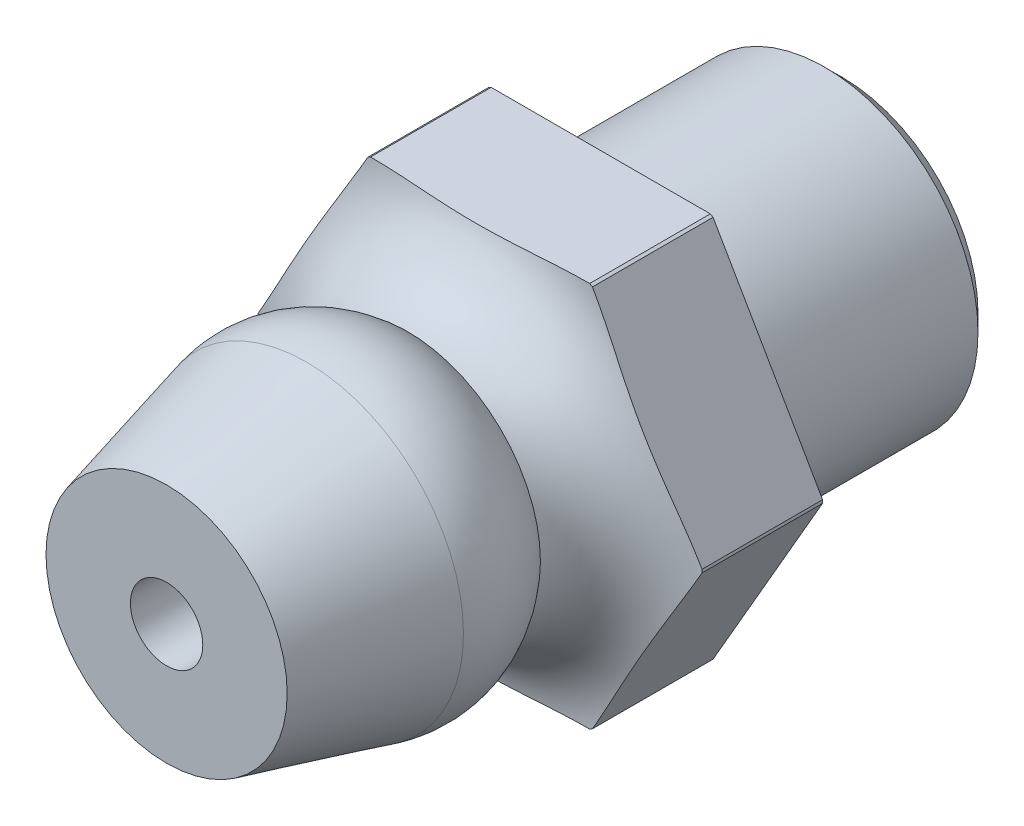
ISO-10303-21;
HEADER;
FILE_DESCRIPTION(('STEP AP214'),'2;1');
FILE_NAME('part.step','',(''),(''),'','','');
FILE_SCHEMA(('AUTOMOTIVE_DESIGN { 1 0 10303 214 1 1 1 1 }'));
ENDSEC;
DATA;
#1=APPLICATION_CONTEXT('core data for automotive mechanical design processes');
#2=APPLICATION_PROTOCOL_DEFINITION('international standard','automotive_design',2000,#1);
#3=PRODUCT_CONTEXT('',#1,'mechanical');
#4=PRODUCT('Part','Part','',(#3));
#5=PRODUCT_RELATED_PRODUCT_CATEGORY('part','',(#4));
#6=PRODUCT_DEFINITION_FORMATION('','',#4);
#7=PRODUCT_DEFINITION_CONTEXT('part definition',#1,'design');
#8=PRODUCT_DEFINITION('design','',#6,#7);
#9=PRODUCT_DEFINITION_SHAPE('','',#8);
#10=(LENGTH_UNIT() NAMED_UNIT(*) SI_UNIT(.MILLI.,.METRE.));
#11=(NAMED_UNIT(*) PLANE_ANGLE_UNIT() SI_UNIT($,.RADIAN.));
#12=(NAMED_UNIT(*) SI_UNIT($,.STERADIAN.) SOLID_ANGLE_UNIT());
#13=UNCERTAINTY_MEASURE_WITH_UNIT(LENGTH_MEASURE(1.E-05),#10,'distance_accuracy_value','');
#14=(GEOMETRIC_REPRESENTATION_CONTEXT(3) GLOBAL_UNCERTAINTY_ASSIGNED_CONTEXT((#13)) GLOBAL_UNIT_ASSIGNED_CONTEXT((#10,
#11,#12)) REPRESENTATION_CONTEXT('',''));
#15=CARTESIAN_POINT('',(0.,0.,0.));
#16=DIRECTION('',(0.,0.,1.));
#17=DIRECTION('',(1.,0.,0.));
#18=AXIS2_PLACEMENT_3D('',#15,#16,#17);
#19=CARTESIAN_POINT('',(0.,0.,4.39083333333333));
#20=DIRECTION('',(0.,0.,1.));
#21=DIRECTION('',(1.,0.,0.));
#22=AXIS2_PLACEMENT_3D('',#19,#20,#21);
#23=TOROIDAL_SURFACE('',#22,4.6,1.89083333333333);
#24=CARTESIAN_POINT('',(0.,0.,4.));
#25=DIRECTION('',(0.,0.,1.));
#26=DIRECTION('',(1.,0.,0.));
#27=AXIS2_PLACEMENT_3D('',#24,#25,#26);
#28=CIRCLE('',#27,2.75);
#29=CARTESIAN_POINT('',(2.75,0.,4.));
#30=VERTEX_POINT('',#29);
#31=EDGE_CURVE('E143',#30,#30,#28,.T.);
#32=ORIENTED_EDGE('',*,*,#31,.F.);
#33=EDGE_LOOP('',(#32));
#34=FACE_BOUND('',#33,.T.);
#35=CARTESIAN_POINT('',(0.,0.,2.5));
#36=DIRECTION('',(0.,0.,1.));
#37=DIRECTION('',(1.,0.,0.));
#38=AXIS2_PLACEMENT_3D('',#35,#36,#37);
#39=CIRCLE('',#38,4.6);
#40=CARTESIAN_POINT('',(-4.59988328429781,0.0327684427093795,2.5));
#41=VERTEX_POINT('',#40);
#42=CARTESIAN_POINT('',(-4.59988328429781,-0.0327684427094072,2.5));
#43=VERTEX_POINT('',#42);
#44=EDGE_CURVE('E184',#41,#43,#39,.T.);
#45=ORIENTED_EDGE('',*,*,#44,.T.);
#46=CARTESIAN_POINT('',(-4.6002,-0.0322198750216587,2.50000002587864));
#47=CARTESIAN_POINT('',(-4.52118096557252,-0.169084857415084,2.50001952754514));
#48=CARTESIAN_POINT('',(-4.44225115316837,-0.305795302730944,2.50480865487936));
#49=CARTESIAN_POINT('',(-4.28450655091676,-0.579016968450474,2.51954652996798));
#50=CARTESIAN_POINT('',(-4.20569175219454,-0.715528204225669,2.52949485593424));
#51=CARTESIAN_POINT('',(-4.04831823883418,-0.988107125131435,2.5501444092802));
#52=CARTESIAN_POINT('',(-3.96975941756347,-1.12417499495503,2.56084348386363));
#53=CARTESIAN_POINT('',(-3.81255747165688,-1.39645675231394,2.57921557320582));
#54=CARTESIAN_POINT('',(-3.73391437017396,-1.53267059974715,2.58688927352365));
#55=CARTESIAN_POINT('',(-3.57635851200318,-1.80556535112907,2.5965744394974));
#56=CARTESIAN_POINT('',(-3.49744554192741,-1.94224662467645,2.59857346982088));
#57=CARTESIAN_POINT('',(-3.33963748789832,-2.21557819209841,2.59617536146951));
#58=CARTESIAN_POINT('',(-3.26074240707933,-2.35222848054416,2.59177748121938));
#59=CARTESIAN_POINT('',(-3.10307853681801,-2.6253103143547,2.57811697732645));
#60=CARTESIAN_POINT('',(-3.02430973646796,-2.76174187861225,2.56885479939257));
#61=CARTESIAN_POINT('',(-2.8668290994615,-3.03450634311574,2.54868193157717));
#62=CARTESIAN_POINT('',(-2.78811726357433,-3.17083924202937,2.53777121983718));
#63=CARTESIAN_POINT('',(-2.67606454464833,-3.36492024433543,2.52398401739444));
#64=CARTESIAN_POINT('',(-2.64275643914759,-3.42261157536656,2.52010491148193));
#65=CARTESIAN_POINT('',(-2.5761265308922,-3.53801796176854,2.5131172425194));
#66=CARTESIAN_POINT('',(-2.54280473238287,-3.59573300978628,2.51000852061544));
#67=CARTESIAN_POINT('',(-2.47613243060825,-3.7112128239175,2.5048940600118));
#68=CARTESIAN_POINT('',(-2.44278192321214,-3.76897759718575,2.50288852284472));
#69=CARTESIAN_POINT('',(-2.37605013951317,-3.88456043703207,2.50032169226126));
#70=CARTESIAN_POINT('',(-2.34266885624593,-3.94237851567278,2.49976115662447));
#71=CARTESIAN_POINT('',(-2.30928560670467,-4.0002,2.5000946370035));
#72=B_SPLINE_CURVE_WITH_KNOTS('',3,(#46,#47,#48,#49,#50,#51,#52,#53,#54,#55,#56,#57,#58,#59,#60,
#61,#62,#63,#64,#65,#66,#67,#68,#69,#70,#71),.UNSPECIFIED.,.F.,.F.,(4,2,2,2,2,2,2,2,2,2,2,2,4),
(0.,0.473805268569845,0.947571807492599,1.42003133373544,1.89238373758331,2.3657704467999,
2.83921203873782,3.312610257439,3.78601475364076,3.9861985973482,4.18634112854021,
4.38652021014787,4.58680424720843),.UNSPECIFIED.);
#73=CARTESIAN_POINT('',(-2.32831994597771,-3.9672315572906,2.5));
#74=VERTEX_POINT('',#73);
#75=EDGE_CURVE('E188',#43,#74,#72,.T.);
#76=ORIENTED_EDGE('',*,*,#75,.T.);
#77=CARTESIAN_POINT('',(-2.2715633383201,-4.,2.5));
#78=VERTEX_POINT('',#77);
#79=EDGE_CURVE('E270',#74,#78,#39,.T.);
#80=ORIENTED_EDGE('',*,*,#79,.T.);
#81=CARTESIAN_POINT('',(0.,-4.,2.59772131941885));
#82=CARTESIAN_POINT('',(0.080272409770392,-4.,2.59772363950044));
#83=CARTESIAN_POINT('',(0.160543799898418,-4.,2.59690584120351));
#84=CARTESIAN_POINT('',(0.32105656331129,-4.,2.59372303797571));
#85=CARTESIAN_POINT('',(0.401297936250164,-4.,2.59135801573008));
#86=CARTESIAN_POINT('',(0.641978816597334,-4.,2.58222964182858));
#87=CARTESIAN_POINT('',(0.802337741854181,-4.,2.57343313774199));
#88=CARTESIAN_POINT('',(1.12420710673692,-4.,2.55343026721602));
#89=CARTESIAN_POINT('',(1.28571615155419,-4.,2.54220464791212));
#90=CARTESIAN_POINT('',(1.60885475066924,-4.,2.52173063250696));
#91=CARTESIAN_POINT('',(1.77048428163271,-4.,2.51248192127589));
#92=CARTESIAN_POINT('',(2.08932881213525,-4.,2.5008725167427));
#93=CARTESIAN_POINT('',(2.24653504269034,-4.,2.49831875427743));
#94=CARTESIAN_POINT('',(2.56097782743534,-4.,2.50403451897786));
#95=CARTESIAN_POINT('',(2.718214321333,-4.,2.51231187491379));
#96=CARTESIAN_POINT('',(3.02937330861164,-4.,2.54407704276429));
#97=CARTESIAN_POINT('',(3.18331297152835,-4.,2.56738264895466));
#98=CARTESIAN_POINT('',(3.48686461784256,-4.,2.63342439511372));
#99=CARTESIAN_POINT('',(3.63648729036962,-4.,2.67610719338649));
#100=CARTESIAN_POINT('',(3.83195287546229,-4.,2.74926719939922));
#101=CARTESIAN_POINT('',(3.8817060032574,-4.,2.76948701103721));
#102=CARTESIAN_POINT('',(3.97996364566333,-4.,2.81289009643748));
#103=CARTESIAN_POINT('',(4.02846681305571,-4.,2.83607641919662));
#104=CARTESIAN_POINT('',(4.17200571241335,-4.,2.91047207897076));
#105=CARTESIAN_POINT('',(4.2646883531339,-4.,2.9663787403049));
#106=CARTESIAN_POINT('',(4.44133965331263,-4.,3.09163201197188));
#107=CARTESIAN_POINT('',(4.52525744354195,-4.,3.16105103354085));
#108=CARTESIAN_POINT('',(4.68023083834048,-4.,3.3129477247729));
#109=CARTESIAN_POINT('',(4.75130973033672,-4.,3.39540123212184));
#110=CARTESIAN_POINT('',(4.86645546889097,-4.,3.5573731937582));
#111=CARTESIAN_POINT('',(4.91304964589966,-4.,3.63509239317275));
#112=CARTESIAN_POINT('',(4.99265010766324,-4.,3.79724483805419));
#113=CARTESIAN_POINT('',(5.0256604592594,-4.,3.8816760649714));
#114=CARTESIAN_POINT('',(5.076451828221,-4.,4.05538704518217));
#115=CARTESIAN_POINT('',(5.094174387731,-4.,4.14468403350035));
#116=CARTESIAN_POINT('',(5.11313553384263,-4.,4.32501625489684));
#117=CARTESIAN_POINT('',(5.11437742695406,-4.,4.41605113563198));
#118=CARTESIAN_POINT('',(5.10080162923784,-4.,4.59062820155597));
#119=CARTESIAN_POINT('',(5.08707400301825,-4.,4.67425778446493));
#120=CARTESIAN_POINT('',(5.04597431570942,-4.,4.83806997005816));
#121=CARTESIAN_POINT('',(5.01860254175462,-4.,4.91825264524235));
#122=CARTESIAN_POINT('',(4.95097042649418,-4.,5.0744781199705));
#123=CARTESIAN_POINT('',(4.91051023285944,-4.,5.15043379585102));
#124=CARTESIAN_POINT('',(4.81859470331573,-4.,5.29532218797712));
#125=CARTESIAN_POINT('',(4.76713751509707,-4.,5.36425371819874));
#126=CARTESIAN_POINT('',(4.64910091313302,-4.,5.50117514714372));
#127=CARTESIAN_POINT('',(4.5814923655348,-4.,5.56827437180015));
#128=CARTESIAN_POINT('',(4.43754892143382,-4.,5.69234803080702));
#129=CARTESIAN_POINT('',(4.36120534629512,-4.,5.74931224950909));
#130=CARTESIAN_POINT('',(4.15873784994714,-4.,5.88139954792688));
#131=CARTESIAN_POINT('',(4.0280835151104,-4.,5.94959959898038));
#132=CARTESIAN_POINT('',(3.75777457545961,-4.,6.06415614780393));
#133=CARTESIAN_POINT('',(3.61811227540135,-4.,6.11049368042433));
#134=CARTESIAN_POINT('',(3.24178442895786,-4.,6.20875627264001));
#135=CARTESIAN_POINT('',(3.00105571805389,-4.,6.24474749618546));
#136=CARTESIAN_POINT('',(2.51666239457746,-4.,6.28290060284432));
#137=CARTESIAN_POINT('',(2.27298889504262,-4.,6.28487258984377));
#138=CARTESIAN_POINT('',(1.78205834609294,-4.,6.27140096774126));
#139=CARTESIAN_POINT('',(1.53481551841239,-4.,6.25564399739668));
#140=CARTESIAN_POINT('',(1.16405679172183,-4.,6.23118207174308));
#141=CARTESIAN_POINT('',(1.04048341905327,-4.,6.22289001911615));
#142=CARTESIAN_POINT('',(0.793238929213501,-4.,6.20787020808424));
#143=CARTESIAN_POINT('',(0.669567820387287,-4.,6.20114232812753));
#144=CARTESIAN_POINT('',(0.422177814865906,-4.,6.19071352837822));
#145=CARTESIAN_POINT('',(0.298459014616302,-4.,6.1870104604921));
#146=CARTESIAN_POINT('',(0.0509657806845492,-4.,6.18342347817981));
#147=CARTESIAN_POINT('',(-0.072808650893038,-4.,6.18353942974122));
#148=CARTESIAN_POINT('',(-0.320311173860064,-4.,6.18756690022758));
#149=CARTESIAN_POINT('',(-0.444039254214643,-4.,6.19147904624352));
#150=CARTESIAN_POINT('',(-0.691368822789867,-4.,6.20224854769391));
#151=CARTESIAN_POINT('',(-0.814970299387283,-4.,6.20910615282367));
#152=CARTESIAN_POINT('',(-1.11812094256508,-4.,6.22774882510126));
#153=CARTESIAN_POINT('',(-1.29761391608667,-4.,6.24035795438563));
#154=CARTESIAN_POINT('',(-1.65690667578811,-4.,6.26281492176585));
#155=CARTESIAN_POINT('',(-1.83670657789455,-4.,6.27266119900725));
#156=CARTESIAN_POINT('',(-2.19569349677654,-4.,6.28297282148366));
#157=CARTESIAN_POINT('',(-2.37487848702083,-4.,6.28348918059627));
#158=CARTESIAN_POINT('',(-2.73252045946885,-4.,6.26860507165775));
#159=CARTESIAN_POINT('',(-2.91097816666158,-4.,6.25323241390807));
#160=CARTESIAN_POINT('',(-3.21831375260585,-4.,6.20687138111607));
#161=CARTESIAN_POINT('',(-3.3479380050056,-4.,6.18102605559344));
#162=CARTESIAN_POINT('',(-3.60370428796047,-4.,6.1142682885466));
#163=CARTESIAN_POINT('',(-3.72983757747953,-4.,6.07332116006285));
#164=CARTESIAN_POINT('',(-3.9762918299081,-4.,5.97347875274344));
#165=CARTESIAN_POINT('',(-4.09654964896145,-4.,5.91442394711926));
#166=CARTESIAN_POINT('',(-4.32522585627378,-4.,5.77671326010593));
#167=CARTESIAN_POINT('',(-4.43367132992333,-4.,5.69810363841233));
#168=CARTESIAN_POINT('',(-4.60707988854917,-4.,5.5438683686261));
#169=CARTESIAN_POINT('',(-4.67603349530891,-4.,5.47273351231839));
#170=CARTESIAN_POINT('',(-4.80145678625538,-4.,5.32009845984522));
#171=CARTESIAN_POINT('',(-4.85792914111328,-4.,5.23860048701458));
#172=CARTESIAN_POINT('',(-4.95584392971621,-4.,5.06620814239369));
#173=CARTESIAN_POINT('',(-4.99718171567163,-4.,4.9752537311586));
#174=CARTESIAN_POINT('',(-5.0617162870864,-4.,4.78710679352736));
#175=CARTESIAN_POINT('',(-5.08492522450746,-4.,4.68991849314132));
#176=CARTESIAN_POINT('',(-5.11013289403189,-4.,4.50408480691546));
#177=CARTESIAN_POINT('',(-5.11423933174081,-4.,4.41572123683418));
#178=CARTESIAN_POINT('',(-5.10676487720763,-4.,4.23967677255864));
#179=CARTESIAN_POINT('',(-5.09518867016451,-4.,4.15199568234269));
#180=CARTESIAN_POINT('',(-5.05789508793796,-4.,3.98399693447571));
#181=CARTESIAN_POINT('',(-5.03285717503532,-4.,3.90352630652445));
#182=CARTESIAN_POINT('',(-4.97031813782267,-4.,3.74761656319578));
#183=CARTESIAN_POINT('',(-4.93281621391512,-4.,3.67217777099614));
#184=CARTESIAN_POINT('',(-4.84454915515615,-4.,3.52380400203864));
#185=CARTESIAN_POINT('',(-4.7931639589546,-4.,3.45123972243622));
#186=CARTESIAN_POINT('',(-4.6803493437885,-4.,3.31443086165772));
#187=CARTESIAN_POINT('',(-4.61891443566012,-4.,3.25019086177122));
#188=CARTESIAN_POINT('',(-4.4611556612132,-4.,3.10597724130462));
#189=CARTESIAN_POINT('',(-4.36085180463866,-4.,3.0303450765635));
#190=CARTESIAN_POINT('',(-4.14928685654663,-4.,2.89639773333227));
#191=CARTESIAN_POINT('',(-4.03800451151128,-4.,2.83811705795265));
#192=CARTESIAN_POINT('',(-3.75753632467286,-4.,2.71526557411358));
#193=CARTESIAN_POINT('',(-3.58457329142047,-4.,2.65938472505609));
#194=CARTESIAN_POINT('',(-3.23259009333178,-4.,2.57500055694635));
#195=CARTESIAN_POINT('',(-3.05356837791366,-4.,2.54650430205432));
#196=CARTESIAN_POINT('',(-2.6368623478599,-4.,2.50406341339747));
#197=CARTESIAN_POINT('',(-2.39850724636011,-4.,2.49755675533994));
#198=CARTESIAN_POINT('',(-1.92167011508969,-4.,2.50398650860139));
#199=CARTESIAN_POINT('',(-1.68319112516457,-4.,2.51699782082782));
#200=CARTESIAN_POINT('',(-1.32429429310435,-4.,2.53977206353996));
#201=CARTESIAN_POINT('',(-1.20375328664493,-4.,2.5479643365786));
#202=CARTESIAN_POINT('',(-0.962616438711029,-4.,2.5636202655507));
#203=CARTESIAN_POINT('',(-0.842020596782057,-4.,2.5710839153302));
#204=CARTESIAN_POINT('',(-0.601231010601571,-4.,2.58370127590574));
#205=CARTESIAN_POINT('',(-0.48103782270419,-4.,2.58886497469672));
#206=CARTESIAN_POINT('',(-0.240562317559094,-4.,2.59587303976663));
#207=CARTESIAN_POINT('',(-0.120280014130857,-4.,2.59771784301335));
#208=CARTESIAN_POINT('',(0.,-4.,2.59772131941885));
#209=B_SPLINE_CURVE_WITH_KNOTS('',3,(#81,#82,#83,#84,#85,#86,#87,#88,#89,#90,#91,#92,#93,#94,
#95,#96,#97,#98,#99,#100,#101,#102,#103,#104,#105,#106,#107,#108,#109,#110,#111,#112,#113,#114,
#115,#116,#117,#118,#119,#120,#121,#122,#123,#124,#125,#126,#127,#128,#129,#130,#131,#132,#133,
#134,#135,#136,#137,#138,#139,#140,#141,#142,#143,#144,#145,#146,#147,#148,#149,#150,#151,#152,
#153,#154,#155,#156,#157,#158,#159,#160,#161,#162,#163,#164,#165,#166,#167,#168,#169,#170,#171,
#172,#173,#174,#175,#176,#177,#178,#179,#180,#181,#182,#183,#184,#185,#186,#187,#188,#189,#190,
#191,#192,#193,#194,#195,#196,#197,#198,#199,#200,#201,#202,#203,#204,#205,#206,#207,#208),
.UNSPECIFIED.,.T.,.F.,(4,2,2,2,2,2,2,2,2,2,2,2,2,2,2,2,2,2,2,2,2,2,2,2,2,2,2,2,2,2,2,2,2,2,2,2,
2,2,2,2,2,2,2,2,2,2,2,2,2,2,2,2,2,2,2,2,2,2,2,2,2,2,2,4),(0.,0.24081176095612,0.48162621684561,
0.963367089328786,1.44907598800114,1.93470740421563,2.40617178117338,2.87797712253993,
3.3441670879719,3.80908143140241,3.97011518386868,4.13131579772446,4.45492982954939,
4.78032834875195,5.10513059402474,5.37582486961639,5.64643804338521,5.91808146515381,
6.18967038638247,6.44272707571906,6.6957784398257,6.95289216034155,7.21004922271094,
7.49473392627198,7.77970397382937,8.21933087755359,8.65933844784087,9.38525528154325,
10.1152228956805,10.8582982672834,11.2298643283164,11.6014015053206,11.9726746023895,
12.3439346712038,12.7152560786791,13.0866089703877,13.6264253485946,14.1665460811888,
14.7037126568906,15.2399406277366,15.635756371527,16.0324869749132,16.4328183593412,
16.8322115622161,17.1282632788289,17.4242515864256,17.7222494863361,18.0200474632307,
18.2840578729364,18.547989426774,18.7997025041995,19.0514317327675,19.3171172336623,
19.5829483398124,19.957723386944,20.3332387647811,20.8754297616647,21.4177605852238,
22.1313703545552,22.8477256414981,23.2101917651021,23.5726609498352,23.9335403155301,
24.2943721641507),.UNSPECIFIED.);
#210=CARTESIAN_POINT('',(2.2715633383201,-4.,2.5));
#211=VERTEX_POINT('',#210);
#212=EDGE_CURVE('E124',#78,#211,#209,.T.);
#213=ORIENTED_EDGE('',*,*,#212,.T.);
#214=CARTESIAN_POINT('',(2.32831994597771,-3.96723155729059,2.5));
#215=VERTEX_POINT('',#214);
#216=EDGE_CURVE('E122',#211,#215,#39,.T.);
#217=ORIENTED_EDGE('',*,*,#216,.T.);
#218=CARTESIAN_POINT('',(2.30928560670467,-4.0002,2.5000946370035));
#219=CARTESIAN_POINT('',(2.38830838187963,-3.86332853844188,2.49933452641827));
#220=CARTESIAN_POINT('',(2.46724836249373,-3.72660048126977,2.5035288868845));
#221=CARTESIAN_POINT('',(2.6250010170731,-3.45336486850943,2.51742683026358));
#222=CARTESIAN_POINT('',(2.70381371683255,-3.3168572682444,2.52712910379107));
#223=CARTESIAN_POINT('',(2.86120164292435,-3.0442533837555,2.54762275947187));
#224=CARTESIAN_POINT('',(2.93977699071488,-2.90815688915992,2.55841151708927));
#225=CARTESIAN_POINT('',(3.09700999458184,-2.63582133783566,2.57723184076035));
#226=CARTESIAN_POINT('',(3.17566763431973,-2.49958230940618,2.58526387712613));
#227=CARTESIAN_POINT('',(3.33323523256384,-2.22666722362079,2.59580826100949));
#228=CARTESIAN_POINT('',(3.41214538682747,-2.08999082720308,2.59831012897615));
#229=CARTESIAN_POINT('',(3.56995554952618,-1.8166556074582,2.5968895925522));
#230=CARTESIAN_POINT('',(3.64885555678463,-1.67999678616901,2.59296671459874));
#231=CARTESIAN_POINT('',(3.8065258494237,-1.4069038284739,2.58006459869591));
#232=CARTESIAN_POINT('',(3.88529615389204,-1.27046965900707,2.57108618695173));
#233=CARTESIAN_POINT('',(4.04277213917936,-0.997713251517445,2.55118641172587));
#234=CARTESIAN_POINT('',(4.12147781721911,-0.861391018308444,2.54026496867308));
#235=CARTESIAN_POINT('',(4.23351112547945,-0.667343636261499,2.52622181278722));
#236=CARTESIAN_POINT('',(4.26681008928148,-0.609668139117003,2.52223660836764));
#237=CARTESIAN_POINT('',(4.33342155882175,-0.494293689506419,2.51497459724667));
#238=CARTESIAN_POINT('',(4.36673406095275,-0.436594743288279,2.51169766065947));
#239=CARTESIAN_POINT('',(4.43338899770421,-0.321145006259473,2.50618328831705));
#240=CARTESIAN_POINT('',(4.46673143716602,-0.263394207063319,2.50394607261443));
#241=CARTESIAN_POINT('',(4.53344791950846,-0.147837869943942,2.500851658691));
#242=CARTESIAN_POINT('',(4.56682196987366,-0.0900323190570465,2.49999513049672));
#243=CARTESIAN_POINT('',(4.6002,-0.0322198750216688,2.50000002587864));
#244=B_SPLINE_CURVE_WITH_KNOTS('',3,(#218,#219,#220,#221,#222,#223,#224,#225,#226,#227,#228,
#229,#230,#231,#232,#233,#234,#235,#236,#237,#238,#239,#240,#241,#242,#243),.UNSPECIFIED.,.F.,
.F.,(4,2,2,2,2,2,2,2,2,2,2,2,4),(0.,0.473810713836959,0.947508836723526,1.42008894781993,
1.8925883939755,2.36598245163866,2.83941140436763,3.31276300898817,3.78613400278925,
3.98628249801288,4.18639425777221,4.38654835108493,4.58679954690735),.UNSPECIFIED.);
#245=CARTESIAN_POINT('',(4.59988328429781,-0.0327684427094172,2.5));
#246=VERTEX_POINT('',#245);
#247=EDGE_CURVE('E227',#215,#246,#244,.T.);
#248=ORIENTED_EDGE('',*,*,#247,.T.);
#249=CARTESIAN_POINT('',(4.59988328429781,0.0327684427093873,2.5));
#250=VERTEX_POINT('',#249);
#251=EDGE_CURVE('E139',#246,#250,#39,.T.);
#252=ORIENTED_EDGE('',*,*,#251,.T.);
#253=CARTESIAN_POINT('',(4.6002,0.0322198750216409,2.50000002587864));
#254=CARTESIAN_POINT('',(4.52118096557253,0.16908485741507,2.50001952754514));
#255=CARTESIAN_POINT('',(4.44225115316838,0.305795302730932,2.50480865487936));
#256=CARTESIAN_POINT('',(4.28450655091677,0.579016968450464,2.51954652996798));
#257=CARTESIAN_POINT('',(4.20569175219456,0.715528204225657,2.52949485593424));
#258=CARTESIAN_POINT('',(4.04831823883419,0.988107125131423,2.5501444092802));
#259=CARTESIAN_POINT('',(3.96975941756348,1.12417499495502,2.56084348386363));
#260=CARTESIAN_POINT('',(3.81255747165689,1.39645675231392,2.57921557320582));
#261=CARTESIAN_POINT('',(3.73391437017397,1.53267059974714,2.58688927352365));
#262=CARTESIAN_POINT('',(3.57635851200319,1.80556535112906,2.59657443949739));
#263=CARTESIAN_POINT('',(3.49744554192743,1.94224662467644,2.59857346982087));
#264=CARTESIAN_POINT('',(3.33963748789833,2.2155781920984,2.5961753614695));
#265=CARTESIAN_POINT('',(3.26074240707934,2.35222848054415,2.59177748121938));
#266=CARTESIAN_POINT('',(3.10307853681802,2.6253103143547,2.57811697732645));
#267=CARTESIAN_POINT('',(3.02430973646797,2.76174187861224,2.56885479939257));
#268=CARTESIAN_POINT('',(2.86682909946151,3.03450634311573,2.54868193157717));
#269=CARTESIAN_POINT('',(2.78811726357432,3.17083924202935,2.53777121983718));
#270=CARTESIAN_POINT('',(2.67606454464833,3.36492024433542,2.52398401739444));
#271=CARTESIAN_POINT('',(2.6427564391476,3.42261157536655,2.52010491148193));
#272=CARTESIAN_POINT('',(2.57612653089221,3.53801796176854,2.5131172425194));
#273=CARTESIAN_POINT('',(2.54280473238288,3.59573300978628,2.51000852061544));
#274=CARTESIAN_POINT('',(2.47613243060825,3.7112128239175,2.5048940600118));
#275=CARTESIAN_POINT('',(2.44278192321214,3.76897759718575,2.50288852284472));
#276=CARTESIAN_POINT('',(2.37605013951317,3.88456043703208,2.50032169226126));
#277=CARTESIAN_POINT('',(2.34266885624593,3.94237851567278,2.49976115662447));
#278=CARTESIAN_POINT('',(2.30928560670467,4.0002,2.5000946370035));
#279=B_SPLINE_CURVE_WITH_KNOTS('',3,(#253,#254,#255,#256,#257,#258,#259,#260,#261,#262,#263,
#264,#265,#266,#267,#268,#269,#270,#271,#272,#273,#274,#275,#276,#277,#278),.UNSPECIFIED.,.F.,
.F.,(4,2,2,2,2,2,2,2,2,2,2,2,4),(0.,0.473805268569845,0.947571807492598,1.42003133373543,
1.89238373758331,2.3657704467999,2.83921203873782,3.312610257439,3.78601475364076,
3.9861985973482,4.18634112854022,4.38652021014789,4.58680424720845),.UNSPECIFIED.);
#280=CARTESIAN_POINT('',(2.32831994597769,3.96723155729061,2.5));
#281=VERTEX_POINT('',#280);
#282=EDGE_CURVE('E236',#250,#281,#279,.T.);
#283=ORIENTED_EDGE('',*,*,#282,.T.);
#284=CARTESIAN_POINT('',(2.27156333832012,4.,2.5));
#285=VERTEX_POINT('',#284);
#286=EDGE_CURVE('E142',#281,#285,#39,.T.);
#287=ORIENTED_EDGE('',*,*,#286,.T.);
#288=CARTESIAN_POINT('',(0.,4.,2.59772131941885));
#289=CARTESIAN_POINT('',(-0.080272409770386,4.,2.59772363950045));
#290=CARTESIAN_POINT('',(-0.160543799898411,4.,2.59690584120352));
#291=CARTESIAN_POINT('',(-0.321056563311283,4.,2.5937230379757));
#292=CARTESIAN_POINT('',(-0.401297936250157,4.,2.59135801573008));
#293=CARTESIAN_POINT('',(-0.641978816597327,4.,2.58222964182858));
#294=CARTESIAN_POINT('',(-0.802337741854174,4.,2.57343313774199));
#295=CARTESIAN_POINT('',(-1.12420710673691,4.,2.55343026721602));
#296=CARTESIAN_POINT('',(-1.28571615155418,4.,2.54220464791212));
#297=CARTESIAN_POINT('',(-1.60885475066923,4.,2.52173063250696));
#298=CARTESIAN_POINT('',(-1.7704842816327,4.,2.51248192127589));
#299=CARTESIAN_POINT('',(-2.08932881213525,4.,2.5008725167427));
#300=CARTESIAN_POINT('',(-2.24653504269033,4.,2.49831875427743));
#301=CARTESIAN_POINT('',(-2.56097782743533,4.,2.50403451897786));
#302=CARTESIAN_POINT('',(-2.718214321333,4.,2.51231187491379));
#303=CARTESIAN_POINT('',(-3.02937330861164,4.,2.54407704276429));
#304=CARTESIAN_POINT('',(-3.18331297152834,4.,2.56738264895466));
#305=CARTESIAN_POINT('',(-3.48686461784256,4.,2.63342439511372));
#306=CARTESIAN_POINT('',(-3.63648729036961,4.,2.67610719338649));
#307=CARTESIAN_POINT('',(-3.83195287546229,4.,2.74926719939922));
#308=CARTESIAN_POINT('',(-3.88170600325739,4.,2.76948701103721));
#309=CARTESIAN_POINT('',(-3.97996364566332,4.,2.81289009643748));
#310=CARTESIAN_POINT('',(-4.0284668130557,4.,2.83607641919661));
#311=CARTESIAN_POINT('',(-4.17200571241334,4.,2.91047207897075));
#312=CARTESIAN_POINT('',(-4.2646883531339,4.,2.96637874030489));
#313=CARTESIAN_POINT('',(-4.44133965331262,4.,3.09163201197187));
#314=CARTESIAN_POINT('',(-4.52525744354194,4.,3.16105103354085));
#315=CARTESIAN_POINT('',(-4.68023083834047,4.,3.3129477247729));
#316=CARTESIAN_POINT('',(-4.75130973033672,4.,3.39540123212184));
#317=CARTESIAN_POINT('',(-4.86645546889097,4.,3.55737319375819));
#318=CARTESIAN_POINT('',(-4.91304964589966,4.,3.63509239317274));
#319=CARTESIAN_POINT('',(-4.99265010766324,4.,3.79724483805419));
#320=CARTESIAN_POINT('',(-5.0256604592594,4.,3.8816760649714));
#321=CARTESIAN_POINT('',(-5.076451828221,4.,4.05538704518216));
#322=CARTESIAN_POINT('',(-5.09417438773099,4.,4.14468403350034));
#323=CARTESIAN_POINT('',(-5.11313553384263,4.,4.32501625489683));
#324=CARTESIAN_POINT('',(-5.11437742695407,4.,4.41605113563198));
#325=CARTESIAN_POINT('',(-5.10080162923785,4.,4.59062820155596));
#326=CARTESIAN_POINT('',(-5.08707400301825,4.,4.67425778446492));
#327=CARTESIAN_POINT('',(-5.04597431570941,4.,4.83806997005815));
#328=CARTESIAN_POINT('',(-5.01860254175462,4.,4.91825264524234));
#329=CARTESIAN_POINT('',(-4.95097042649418,4.,5.0744781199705));
#330=CARTESIAN_POINT('',(-4.91051023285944,4.,5.15043379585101));
#331=CARTESIAN_POINT('',(-4.81859470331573,4.,5.29532218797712));
#332=CARTESIAN_POINT('',(-4.76713751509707,4.,5.36425371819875));
#333=CARTESIAN_POINT('',(-4.64910091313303,4.,5.50117514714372));
#334=CARTESIAN_POINT('',(-4.5814923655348,4.,5.56827437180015));
#335=CARTESIAN_POINT('',(-4.43754892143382,4.,5.69234803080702));
#336=CARTESIAN_POINT('',(-4.36120534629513,4.,5.74931224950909));
#337=CARTESIAN_POINT('',(-4.15873784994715,4.,5.88139954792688));
#338=CARTESIAN_POINT('',(-4.02808351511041,4.,5.94959959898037));
#339=CARTESIAN_POINT('',(-3.75777457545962,4.,6.06415614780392));
#340=CARTESIAN_POINT('',(-3.61811227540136,4.,6.11049368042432));
#341=CARTESIAN_POINT('',(-3.24178442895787,4.,6.20875627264));
#342=CARTESIAN_POINT('',(-3.00105571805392,4.,6.24474749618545));
#343=CARTESIAN_POINT('',(-2.51666239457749,4.,6.28290060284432));
#344=CARTESIAN_POINT('',(-2.27298889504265,4.,6.28487258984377));
#345=CARTESIAN_POINT('',(-1.78205834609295,4.,6.27140096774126));
#346=CARTESIAN_POINT('',(-1.53481551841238,4.,6.25564399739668));
#347=CARTESIAN_POINT('',(-1.16405679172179,4.,6.23118207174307));
#348=CARTESIAN_POINT('',(-1.04048341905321,4.,6.22289001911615));
#349=CARTESIAN_POINT('',(-0.79323892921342,4.,6.20787020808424));
#350=CARTESIAN_POINT('',(-0.669567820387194,4.,6.20114232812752));
#351=CARTESIAN_POINT('',(-0.42217781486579,4.,6.19071352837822));
#352=CARTESIAN_POINT('',(-0.298459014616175,4.,6.18701046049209));
#353=CARTESIAN_POINT('',(-0.0509657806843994,4.,6.18342347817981));
#354=CARTESIAN_POINT('',(0.0728086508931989,4.,6.18353942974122));
#355=CARTESIAN_POINT('',(0.320311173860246,4.,6.18756690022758));
#356=CARTESIAN_POINT('',(0.444039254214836,4.,6.19147904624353));
#357=CARTESIAN_POINT('',(0.691368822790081,4.,6.20224854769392));
#358=CARTESIAN_POINT('',(0.814970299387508,4.,6.20910615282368));
#359=CARTESIAN_POINT('',(1.11812094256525,4.,6.22774882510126));
#360=CARTESIAN_POINT('',(1.29761391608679,4.,6.24035795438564));
#361=CARTESIAN_POINT('',(1.6569066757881,4.,6.26281492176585));
#362=CARTESIAN_POINT('',(1.83670657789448,4.,6.27266119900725));
#363=CARTESIAN_POINT('',(2.19569349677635,4.,6.28297282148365));
#364=CARTESIAN_POINT('',(2.37487848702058,4.,6.28348918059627));
#365=CARTESIAN_POINT('',(2.73252045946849,4.,6.26860507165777));
#366=CARTESIAN_POINT('',(2.91097816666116,4.,6.25323241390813));
#367=CARTESIAN_POINT('',(3.21831375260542,4.,6.20687138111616));
#368=CARTESIAN_POINT('',(3.34793800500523,4.,6.18102605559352));
#369=CARTESIAN_POINT('',(3.6037042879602,4.,6.11426828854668));
#370=CARTESIAN_POINT('',(3.72983757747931,4.,6.07332116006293));
#371=CARTESIAN_POINT('',(3.97629182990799,4.,5.9734787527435));
#372=CARTESIAN_POINT('',(4.09654964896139,4.,5.9144239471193));
#373=CARTESIAN_POINT('',(4.32522585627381,4.,5.77671326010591));
#374=CARTESIAN_POINT('',(4.43367132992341,4.,5.69810363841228));
#375=CARTESIAN_POINT('',(4.60707988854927,4.,5.54386836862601));
#376=CARTESIAN_POINT('',(4.676033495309,4.,5.47273351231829));
#377=CARTESIAN_POINT('',(4.80145678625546,4.,5.32009845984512));
#378=CARTESIAN_POINT('',(4.85792914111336,4.,5.23860048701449));
#379=CARTESIAN_POINT('',(4.95584392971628,4.,5.0662081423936));
#380=CARTESIAN_POINT('',(4.99718171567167,4.,4.9752537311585));
#381=CARTESIAN_POINT('',(5.06171628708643,4.,4.78710679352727));
#382=CARTESIAN_POINT('',(5.08492522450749,4.,4.68991849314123));
#383=CARTESIAN_POINT('',(5.11013289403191,4.,4.50408480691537));
#384=CARTESIAN_POINT('',(5.11423933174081,4.,4.41572123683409));
#385=CARTESIAN_POINT('',(5.10676487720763,4.,4.23967677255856));
#386=CARTESIAN_POINT('',(5.09518867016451,4.,4.15199568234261));
#387=CARTESIAN_POINT('',(5.05789508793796,4.,3.98399693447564));
#388=CARTESIAN_POINT('',(5.0328571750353,4.,3.90352630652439));
#389=CARTESIAN_POINT('',(4.97031813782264,4.,3.74761656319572));
#390=CARTESIAN_POINT('',(4.93281621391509,4.,3.67217777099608));
#391=CARTESIAN_POINT('',(4.84454915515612,4.,3.52380400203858));
#392=CARTESIAN_POINT('',(4.79316395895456,4.,3.45123972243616));
#393=CARTESIAN_POINT('',(4.68034934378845,4.,3.31443086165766));
#394=CARTESIAN_POINT('',(4.61891443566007,4.,3.25019086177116));
#395=CARTESIAN_POINT('',(4.46115566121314,4.,3.10597724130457));
#396=CARTESIAN_POINT('',(4.36085180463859,4.,3.03034507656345));
#397=CARTESIAN_POINT('',(4.14928685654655,4.,2.89639773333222));
#398=CARTESIAN_POINT('',(4.03800451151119,4.,2.8381170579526));
#399=CARTESIAN_POINT('',(3.75753632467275,4.,2.71526557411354));
#400=CARTESIAN_POINT('',(3.58457329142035,4.,2.65938472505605));
#401=CARTESIAN_POINT('',(3.23259009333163,4.,2.57500055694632));
#402=CARTESIAN_POINT('',(3.05356837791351,4.,2.5465043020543));
#403=CARTESIAN_POINT('',(2.63686234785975,4.,2.50406341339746));
#404=CARTESIAN_POINT('',(2.39850724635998,4.,2.49755675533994));
#405=CARTESIAN_POINT('',(1.92167011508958,4.,2.5039865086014));
#406=CARTESIAN_POINT('',(1.68319112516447,4.,2.51699782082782));
#407=CARTESIAN_POINT('',(1.32429429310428,4.,2.53977206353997));
#408=CARTESIAN_POINT('',(1.20375328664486,4.,2.5479643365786));
#409=CARTESIAN_POINT('',(0.962616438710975,4.,2.5636202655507));
#410=CARTESIAN_POINT('',(0.842020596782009,4.,2.57108391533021));
#411=CARTESIAN_POINT('',(0.601231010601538,4.,2.58370127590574));
#412=CARTESIAN_POINT('',(0.481037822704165,4.,2.58886497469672));
#413=CARTESIAN_POINT('',(0.240562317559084,4.,2.59587303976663));
#414=CARTESIAN_POINT('',(0.120280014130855,4.,2.59771784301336));
#415=CARTESIAN_POINT('',(0.,4.,2.59772131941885));
#416=B_SPLINE_CURVE_WITH_KNOTS('',3,(#288,#289,#290,#291,#292,#293,#294,#295,#296,#297,#298,
#299,#300,#301,#302,#303,#304,#305,#306,#307,#308,#309,#310,#311,#312,#313,#314,#315,#316,#317,
#318,#319,#320,#321,#322,#323,#324,#325,#326,#327,#328,#329,#330,#331,#332,#333,#334,#335,#336,
#337,#338,#339,#340,#341,#342,#343,#344,#345,#346,#347,#348,#349,#350,#351,#352,#353,#354,#355,
#356,#357,#358,#359,#360,#361,#362,#363,#364,#365,#366,#367,#368,#369,#370,#371,#372,#373,#374,
#375,#376,#377,#378,#379,#380,#381,#382,#383,#384,#385,#386,#387,#388,#389,#390,#391,#392,#393,
#394,#395,#396,#397,#398,#399,#400,#401,#402,#403,#404,#405,#406,#407,#408,#409,#410,#411,#412,
#413,#414,#415),.UNSPECIFIED.,.T.,.F.,(4,2,2,2,2,2,2,2,2,2,2,2,2,2,2,2,2,2,2,2,2,2,2,2,2,2,2,2,
2,2,2,2,2,2,2,2,2,2,2,2,2,2,2,2,2,2,2,2,2,2,2,2,2,2,2,2,2,2,2,2,2,2,2,4),(0.,0.24081176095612,
0.481626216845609,0.963367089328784,1.44907598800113,1.93470740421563,2.40617178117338,
2.87797712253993,3.3441670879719,3.80908143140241,3.97011518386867,4.13131579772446,
4.45492982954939,4.78032834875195,5.10513059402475,5.37582486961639,5.64643804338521,
5.91808146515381,6.18967038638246,6.44272707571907,6.69577843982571,6.95289216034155,
7.21004922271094,7.49473392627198,7.77970397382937,8.21933087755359,8.65933844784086,
9.38525528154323,10.1152228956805,10.8582982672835,11.2298643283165,11.6014015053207,
11.9726746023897,12.3439346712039,12.7152560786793,13.086608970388,13.6264253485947,
14.1665460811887,14.7037126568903,15.2399406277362,15.6357563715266,16.0324869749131,
16.4328183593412,16.8322115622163,17.128263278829,17.4242515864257,17.7222494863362,
18.0200474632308,18.2840578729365,18.5479894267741,18.7997025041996,19.0514317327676,
19.3171172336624,19.5829483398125,19.9577233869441,20.3332387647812,20.8754297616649,
21.417760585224,22.1313703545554,22.8477256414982,23.2101917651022,23.5726609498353,
23.9335403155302,24.2943721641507),.UNSPECIFIED.);
#417=CARTESIAN_POINT('',(-2.27156333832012,4.,2.5));
#418=VERTEX_POINT('',#417);
#419=EDGE_CURVE('E255',#285,#418,#416,.T.);
#420=ORIENTED_EDGE('',*,*,#419,.T.);
#421=CARTESIAN_POINT('',(-2.32831994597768,3.96723155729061,2.5));
#422=VERTEX_POINT('',#421);
#423=EDGE_CURVE('E269',#418,#422,#39,.T.);
#424=ORIENTED_EDGE('',*,*,#423,.T.);
#425=CARTESIAN_POINT('',(-2.30928560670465,4.0002,2.5000946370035));
#426=CARTESIAN_POINT('',(-2.38830838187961,3.86332853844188,2.49933452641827));
#427=CARTESIAN_POINT('',(-2.46724836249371,3.72660048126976,2.5035288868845));
#428=CARTESIAN_POINT('',(-2.62500101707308,3.45336486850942,2.51742683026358));
#429=CARTESIAN_POINT('',(-2.70381371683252,3.3168572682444,2.52712910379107));
#430=CARTESIAN_POINT('',(-2.86120164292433,3.04425338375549,2.54762275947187));
#431=CARTESIAN_POINT('',(-2.93977699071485,2.90815688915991,2.55841151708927));
#432=CARTESIAN_POINT('',(-3.09700999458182,2.63582133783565,2.57723184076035));
#433=CARTESIAN_POINT('',(-3.17566763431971,2.49958230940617,2.58526387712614));
#434=CARTESIAN_POINT('',(-3.33323523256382,2.22666722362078,2.59580826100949));
#435=CARTESIAN_POINT('',(-3.41214538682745,2.08999082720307,2.59831012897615));
#436=CARTESIAN_POINT('',(-3.56995554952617,1.81665560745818,2.59688959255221));
#437=CARTESIAN_POINT('',(-3.64885555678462,1.67999678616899,2.59296671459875));
#438=CARTESIAN_POINT('',(-3.80652584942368,1.40690382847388,2.58006459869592));
#439=CARTESIAN_POINT('',(-3.88529615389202,1.27046965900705,2.57108618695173));
#440=CARTESIAN_POINT('',(-4.04277213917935,0.997713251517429,2.55118641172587));
#441=CARTESIAN_POINT('',(-4.1214778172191,0.861391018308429,2.54026496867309));
#442=CARTESIAN_POINT('',(-4.23351112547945,0.66734363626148,2.52622181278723));
#443=CARTESIAN_POINT('',(-4.26681008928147,0.60966813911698,2.52223660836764));
#444=CARTESIAN_POINT('',(-4.33342155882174,0.494293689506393,2.51497459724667));
#445=CARTESIAN_POINT('',(-4.36673406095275,0.436594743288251,2.51169766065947));
#446=CARTESIAN_POINT('',(-4.4333889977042,0.321145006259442,2.50618328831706));
#447=CARTESIAN_POINT('',(-4.46673143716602,0.263394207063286,2.50394607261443));
#448=CARTESIAN_POINT('',(-4.53344791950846,0.147837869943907,2.500851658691));
#449=CARTESIAN_POINT('',(-4.56682196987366,0.0900323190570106,2.49999513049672));
#450=CARTESIAN_POINT('',(-4.6002,0.0322198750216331,2.50000002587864));
#451=B_SPLINE_CURVE_WITH_KNOTS('',3,(#425,#426,#427,#428,#429,#430,#431,#432,#433,#434,#435,
#436,#437,#438,#439,#440,#441,#442,#443,#444,#445,#446,#447,#448,#449,#450),.UNSPECIFIED.,.F.,
.F.,(4,2,2,2,2,2,2,2,2,2,2,2,4),(0.,0.473810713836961,0.94750883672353,1.42008894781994,
1.89258839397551,2.36598245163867,2.83941140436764,3.31276300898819,3.78613400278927,
3.9862824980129,4.18639425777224,4.38654835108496,4.58679954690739),.UNSPECIFIED.);
#452=EDGE_CURVE('E186',#422,#41,#451,.T.);
#453=ORIENTED_EDGE('',*,*,#452,.T.);
#454=EDGE_LOOP('',(#45,#76,#80,#213,#217,#248,#252,#283,#287,#420,#424,#453));
#455=FACE_BOUND('',#454,.T.);
#456=ADVANCED_FACE('F16',(#34,#455),#23,.F.);
#457=CARTESIAN_POINT('',(0.,0.,9.));
#458=DIRECTION('',(0.,0.,1.));
#459=DIRECTION('',(1.,0.,0.));
#460=AXIS2_PLACEMENT_3D('',#457,#458,#459);
#461=CYLINDRICAL_SURFACE('',#460,4.6);
#462=ORIENTED_EDGE('',*,*,#79,.F.);
#463=DIRECTION('',(0.,0.,1.));
#464=VECTOR('',#463,1.);
#465=CARTESIAN_POINT('',(-2.32831994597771,-3.9672315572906,9.));
#466=LINE('',#465,#464);
#467=CARTESIAN_POINT('',(-2.32831994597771,-3.9672315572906,0.));
#468=VERTEX_POINT('',#467);
#469=EDGE_CURVE('E204',#74,#468,#466,.F.);
#470=ORIENTED_EDGE('',*,*,#469,.T.);
#471=CARTESIAN_POINT('',(0.,0.,0.));
#472=DIRECTION('',(0.,0.,1.));
#473=DIRECTION('',(1.,0.,0.));
#474=AXIS2_PLACEMENT_3D('',#471,#472,#473);
#475=CIRCLE('',#474,4.6);
#476=CARTESIAN_POINT('',(-2.2715633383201,-4.,0.));
#477=VERTEX_POINT('',#476);
#478=EDGE_CURVE('E129',#468,#477,#475,.T.);
#479=ORIENTED_EDGE('',*,*,#478,.T.);
#480=DIRECTION('',(0.,0.,1.));
#481=VECTOR('',#480,1.);
#482=CARTESIAN_POINT('',(-2.2715633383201,-4.,9.));
#483=LINE('',#482,#481);
#484=EDGE_CURVE('E106',#477,#78,#483,.T.);
#485=ORIENTED_EDGE('',*,*,#484,.T.);
#486=EDGE_LOOP('',(#462,#470,#479,#485));
#487=FACE_BOUND('',#486,.T.);
#488=ADVANCED_FACE('F275',(#487),#461,.T.);
#489=CARTESIAN_POINT('',(-4.59988328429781,0.0327684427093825,0.));
#490=VERTEX_POINT('',#489);
#491=CARTESIAN_POINT('',(-4.59988328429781,-0.032768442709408,0.));
#492=VERTEX_POINT('',#491);
#493=EDGE_CURVE('E132',#490,#492,#475,.T.);
#494=ORIENTED_EDGE('',*,*,#493,.T.);
#495=DIRECTION('',(0.,0.,1.));
#496=VECTOR('',#495,1.);
#497=CARTESIAN_POINT('',(-4.59988328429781,-0.0327684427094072,9.));
#498=LINE('',#497,#496);
#499=EDGE_CURVE('E181',#492,#43,#498,.T.);
#500=ORIENTED_EDGE('',*,*,#499,.T.);
#501=ORIENTED_EDGE('',*,*,#44,.F.);
#502=DIRECTION('',(0.,0.,1.));
#503=VECTOR('',#502,1.);
#504=CARTESIAN_POINT('',(-4.59988328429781,0.0327684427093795,9.));
#505=LINE('',#504,#503);
#506=EDGE_CURVE('E183',#41,#490,#505,.F.);
#507=ORIENTED_EDGE('',*,*,#506,.T.);
#508=EDGE_LOOP('',(#494,#500,#501,#507));
#509=FACE_BOUND('',#508,.T.);
#510=ADVANCED_FACE('F179',(#509),#461,.T.);
#511=CARTESIAN_POINT('',(-2.27156333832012,4.,0.));
#512=VERTEX_POINT('',#511);
#513=CARTESIAN_POINT('',(-2.32831994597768,3.96723155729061,0.));
#514=VERTEX_POINT('',#513);
#515=EDGE_CURVE('E164',#512,#514,#475,.T.);
#516=ORIENTED_EDGE('',*,*,#515,.T.);
#517=DIRECTION('',(0.,0.,1.));
#518=VECTOR('',#517,1.);
#519=CARTESIAN_POINT('',(-2.32831994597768,3.96723155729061,9.));
#520=LINE('',#519,#518);
#521=EDGE_CURVE('E173',#514,#422,#520,.T.);
#522=ORIENTED_EDGE('',*,*,#521,.T.);
#523=ORIENTED_EDGE('',*,*,#423,.F.);
#524=DIRECTION('',(0.,0.,1.));
#525=VECTOR('',#524,1.);
#526=CARTESIAN_POINT('',(-2.27156333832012,4.,9.));
#527=LINE('',#526,#525);
#528=EDGE_CURVE('E175',#418,#512,#527,.F.);
#529=ORIENTED_EDGE('',*,*,#528,.T.);
#530=EDGE_LOOP('',(#516,#522,#523,#529));
#531=FACE_BOUND('',#530,.T.);
#532=ADVANCED_FACE('F171',(#531),#461,.T.);
#533=CARTESIAN_POINT('',(2.32831994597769,3.96723155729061,0.));
#534=VERTEX_POINT('',#533);
#535=CARTESIAN_POINT('',(2.27156333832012,4.,0.));
#536=VERTEX_POINT('',#535);
#537=EDGE_CURVE('E135',#534,#536,#475,.T.);
#538=ORIENTED_EDGE('',*,*,#537,.T.);
#539=DIRECTION('',(0.,0.,1.));
#540=VECTOR('',#539,1.);
#541=CARTESIAN_POINT('',(2.27156333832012,4.,9.));
#542=LINE('',#541,#540);
#543=EDGE_CURVE('E260',#536,#285,#542,.T.);
#544=ORIENTED_EDGE('',*,*,#543,.T.);
#545=ORIENTED_EDGE('',*,*,#286,.F.);
#546=DIRECTION('',(0.,0.,1.));
#547=VECTOR('',#546,1.);
#548=CARTESIAN_POINT('',(2.32831994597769,3.96723155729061,9.));
#549=LINE('',#548,#547);
#550=EDGE_CURVE('E242',#281,#534,#549,.F.);
#551=ORIENTED_EDGE('',*,*,#550,.T.);
#552=EDGE_LOOP('',(#538,#544,#545,#551));
#553=FACE_BOUND('',#552,.T.);
#554=ADVANCED_FACE('F267',(#553),#461,.T.);
#555=CARTESIAN_POINT('',(4.59988328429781,-0.0327684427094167,0.));
#556=VERTEX_POINT('',#555);
#557=CARTESIAN_POINT('',(4.59988328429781,0.0327684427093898,0.));
#558=VERTEX_POINT('',#557);
#559=EDGE_CURVE('E130',#556,#558,#475,.T.);
#560=ORIENTED_EDGE('',*,*,#559,.T.);
#561=DIRECTION('',(0.,0.,1.));
#562=VECTOR('',#561,1.);
#563=CARTESIAN_POINT('',(4.59988328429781,0.0327684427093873,9.));
#564=LINE('',#563,#562);
#565=EDGE_CURVE('E233',#558,#250,#564,.T.);
#566=ORIENTED_EDGE('',*,*,#565,.T.);
#567=ORIENTED_EDGE('',*,*,#251,.F.);
#568=DIRECTION('',(0.,0.,1.));
#569=VECTOR('',#568,1.);
#570=CARTESIAN_POINT('',(4.59988328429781,-0.0327684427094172,9.));
#571=LINE('',#570,#569);
#572=EDGE_CURVE('E31',#246,#556,#571,.F.);
#573=ORIENTED_EDGE('',*,*,#572,.T.);
#574=EDGE_LOOP('',(#560,#566,#567,#573));
#575=FACE_BOUND('',#574,.T.);
#576=ADVANCED_FACE('F333',(#575),#461,.T.);
#577=CARTESIAN_POINT('',(2.2715633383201,-4.,0.));
#578=VERTEX_POINT('',#577);
#579=CARTESIAN_POINT('',(2.32831994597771,-3.96723155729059,0.));
#580=VERTEX_POINT('',#579);
#581=EDGE_CURVE('E120',#578,#580,#475,.T.);
#582=ORIENTED_EDGE('',*,*,#581,.T.);
#583=DIRECTION('',(0.,0.,1.));
#584=VECTOR('',#583,1.);
#585=CARTESIAN_POINT('',(2.32831994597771,-3.96723155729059,9.));
#586=LINE('',#585,#584);
#587=EDGE_CURVE('E123',#580,#215,#586,.T.);
#588=ORIENTED_EDGE('',*,*,#587,.T.);
#589=ORIENTED_EDGE('',*,*,#216,.F.);
#590=DIRECTION('',(0.,0.,1.));
#591=VECTOR('',#590,1.);
#592=CARTESIAN_POINT('',(2.2715633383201,-4.,9.));
#593=LINE('',#592,#591);
#594=EDGE_CURVE('E39',#211,#578,#593,.F.);
#595=ORIENTED_EDGE('',*,*,#594,.T.);
#596=EDGE_LOOP('',(#582,#588,#589,#595));
#597=FACE_BOUND('',#596,.T.);
#598=ADVANCED_FACE('F118',(#597),#461,.T.);
#599=CARTESIAN_POINT('',(4.6,0.,0.));
#600=DIRECTION('',(0.,0.,-1.));
#601=DIRECTION('',(-1.,0.,0.));
#602=AXIS2_PLACEMENT_3D('',#599,#600,#601);
#603=PLANE('',#602);
#604=CARTESIAN_POINT('',(0.,0.,0.));
#605=DIRECTION('',(0.,0.,1.));
#606=DIRECTION('',(1.,0.,0.));
#607=AXIS2_PLACEMENT_3D('',#604,#605,#606);
#608=CIRCLE('',#607,3.175);
#609=CARTESIAN_POINT('',(3.175,0.,0.));
#610=VERTEX_POINT('',#609);
#611=EDGE_CURVE('E134',#610,#610,#608,.T.);
#612=ORIENTED_EDGE('',*,*,#611,.T.);
#613=EDGE_LOOP('',(#612));
#614=FACE_BOUND('',#613,.T.);
#615=ORIENTED_EDGE('',*,*,#478,.F.);
#616=DIRECTION('',(-0.5,0.866025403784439,0.));
#617=VECTOR('',#616,1.);
#618=CARTESIAN_POINT('',(-2.31410161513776,-3.99185842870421,0.));
#619=LINE('',#618,#617);
#620=EDGE_CURVE('E10',#468,#492,#619,.T.);
#621=ORIENTED_EDGE('',*,*,#620,.T.);
#622=ORIENTED_EDGE('',*,*,#493,.F.);
#623=DIRECTION('',(0.5,0.866025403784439,0.));
#624=VECTOR('',#623,1.);
#625=CARTESIAN_POINT('',(-2.31410161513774,3.99185842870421,0.));
#626=LINE('',#625,#624);
#627=EDGE_CURVE('E24',#490,#514,#626,.T.);
#628=ORIENTED_EDGE('',*,*,#627,.T.);
#629=ORIENTED_EDGE('',*,*,#515,.F.);
#630=DIRECTION('',(1.,0.,0.));
#631=VECTOR('',#630,1.);
#632=CARTESIAN_POINT('',(4.6,4.,0.));
#633=LINE('',#632,#631);
#634=EDGE_CURVE('E154',#512,#536,#633,.T.);
#635=ORIENTED_EDGE('',*,*,#634,.T.);
#636=ORIENTED_EDGE('',*,*,#537,.F.);
#637=DIRECTION('',(0.5,-0.866025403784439,0.));
#638=VECTOR('',#637,1.);
#639=CARTESIAN_POINT('',(4.61410161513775,0.00814157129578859,0.));
#640=LINE('',#639,#638);
#641=EDGE_CURVE('E150',#534,#558,#640,.T.);
#642=ORIENTED_EDGE('',*,*,#641,.T.);
#643=ORIENTED_EDGE('',*,*,#559,.F.);
#644=DIRECTION('',(-0.5,-0.866025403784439,0.));
#645=VECTOR('',#644,1.);
#646=CARTESIAN_POINT('',(4.61410161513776,-0.0081415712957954,0.));
#647=LINE('',#646,#645);
#648=EDGE_CURVE('E112',#556,#580,#647,.T.);
#649=ORIENTED_EDGE('',*,*,#648,.T.);
#650=ORIENTED_EDGE('',*,*,#581,.F.);
#651=DIRECTION('',(-1.,0.,0.));
#652=VECTOR('',#651,1.);
#653=CARTESIAN_POINT('',(4.6,-4.,0.));
#654=LINE('',#653,#652);
#655=EDGE_CURVE('E103',#578,#477,#654,.T.);
#656=ORIENTED_EDGE('',*,*,#655,.T.);
#657=EDGE_LOOP('',(#615,#621,#622,#628,#629,#635,#636,#642,#643,#649,#650,#656));
#658=FACE_BOUND('',#657,.T.);
#659=ADVANCED_FACE('F127',(#614,#658),#603,.T.);
#660=CARTESIAN_POINT('',(0.,0.,9.));
#661=DIRECTION('',(0.,0.,-1.));
#662=DIRECTION('',(-1.,0.,0.));
#663=AXIS2_PLACEMENT_3D('',#660,#661,#662);
#664=CONICAL_SURFACE('',#663,2.5,0.252680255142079);
#665=CARTESIAN_POINT('',(0.,0.,6.09526249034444));
#666=DIRECTION('',(0.,0.,1.));
#667=DIRECTION('',(1.,0.,0.));
#668=AXIS2_PLACEMENT_3D('',#665,#666,#667);
#669=CIRCLE('',#668,3.25);
#670=CARTESIAN_POINT('',(3.25,0.,6.09526249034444));
#671=VERTEX_POINT('',#670);
#672=EDGE_CURVE('E113',#671,#671,#669,.T.);
#673=ORIENTED_EDGE('',*,*,#672,.T.);
#674=EDGE_LOOP('',(#673));
#675=FACE_BOUND('',#674,.T.);
#676=CARTESIAN_POINT('',(0.,0.,9.));
#677=DIRECTION('',(0.,0.,1.));
#678=DIRECTION('',(1.,0.,0.));
#679=AXIS2_PLACEMENT_3D('',#676,#677,#678);
#680=CIRCLE('',#679,2.5);
#681=CARTESIAN_POINT('',(2.5,0.,9.));
#682=VERTEX_POINT('',#681);
#683=EDGE_CURVE('E277',#682,#682,#680,.T.);
#684=ORIENTED_EDGE('',*,*,#683,.F.);
#685=EDGE_LOOP('',(#684));
#686=FACE_BOUND('',#685,.T.);
#687=ADVANCED_FACE('F311',(#675,#686),#664,.T.);
#688=CARTESIAN_POINT('',(0.,0.,5.51981509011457));
#689=DIRECTION('',(0.,0.,1.));
#690=DIRECTION('',(1.,0.,0.));
#691=AXIS2_PLACEMENT_3D('',#688,#689,#690);
#692=DEGENERATE_TOROIDAL_SURFACE('',#691,1.02130180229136,2.30178960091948,.T.);
#693=ORIENTED_EDGE('',*,*,#31,.T.);
#694=EDGE_LOOP('',(#693));
#695=FACE_BOUND('',#694,.T.);
#696=ORIENTED_EDGE('',*,*,#672,.F.);
#697=EDGE_LOOP('',(#696));
#698=FACE_BOUND('',#697,.T.);
#699=ADVANCED_FACE('F301',(#695,#698),#692,.T.);
#700=CARTESIAN_POINT('',(0.,0.,9.));
#701=DIRECTION('',(0.,0.,1.));
#702=DIRECTION('',(1.,0.,0.));
#703=AXIS2_PLACEMENT_3D('',#700,#701,#702);
#704=CYLINDRICAL_SURFACE('',#703,3.175);
#705=CARTESIAN_POINT('',(0.,0.,-4.64644660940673));
#706=DIRECTION('',(0.,0.,1.));
#707=DIRECTION('',(1.,0.,0.));
#708=AXIS2_PLACEMENT_3D('',#705,#706,#707);
#709=CIRCLE('',#708,3.175);
#710=CARTESIAN_POINT('',(3.175,0.,-4.64644660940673));
#711=VERTEX_POINT('',#710);
#712=EDGE_CURVE('E290',#711,#711,#709,.T.);
#713=ORIENTED_EDGE('',*,*,#712,.T.);
#714=EDGE_LOOP('',(#713));
#715=FACE_BOUND('',#714,.T.);
#716=ORIENTED_EDGE('',*,*,#611,.F.);
#717=EDGE_LOOP('',(#716));
#718=FACE_BOUND('',#717,.T.);
#719=ADVANCED_FACE('F298',(#715,#718),#704,.T.);
#720=CARTESIAN_POINT('',(0.,0.,-4.64644660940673));
#721=DIRECTION('',(0.,0.,1.));
#722=DIRECTION('',(1.,0.,0.));
#723=AXIS2_PLACEMENT_3D('',#720,#721,#722);
#724=CONICAL_SURFACE('',#723,3.175,0.785398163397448);
#725=CARTESIAN_POINT('',(0.,0.,-5.));
#726=DIRECTION('',(0.,0.,1.));
#727=DIRECTION('',(1.,0.,0.));
#728=AXIS2_PLACEMENT_3D('',#725,#726,#727);
#729=CIRCLE('',#728,2.82144660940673);
#730=CARTESIAN_POINT('',(2.82144660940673,0.,-5.));
#731=VERTEX_POINT('',#730);
#732=EDGE_CURVE('E288',#731,#731,#729,.T.);
#733=ORIENTED_EDGE('',*,*,#732,.T.);
#734=EDGE_LOOP('',(#733));
#735=FACE_BOUND('',#734,.T.);
#736=ORIENTED_EDGE('',*,*,#712,.F.);
#737=EDGE_LOOP('',(#736));
#738=FACE_BOUND('',#737,.T.);
#739=ADVANCED_FACE('F300',(#735,#738),#724,.T.);
#740=CARTESIAN_POINT('',(2.82144660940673,0.,-5.));
#741=DIRECTION('',(0.,0.,-1.));
#742=DIRECTION('',(-1.,0.,0.));
#743=AXIS2_PLACEMENT_3D('',#740,#741,#742);
#744=PLANE('',#743);
#745=CARTESIAN_POINT('',(0.,0.,-5.));
#746=DIRECTION('',(0.,0.,1.));
#747=DIRECTION('',(1.,0.,0.));
#748=AXIS2_PLACEMENT_3D('',#745,#746,#747);
#749=CIRCLE('',#748,0.75);
#750=CARTESIAN_POINT('',(0.750000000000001,0.,-5.));
#751=VERTEX_POINT('',#750);
#752=EDGE_CURVE('E283',#751,#751,#749,.T.);
#753=ORIENTED_EDGE('',*,*,#752,.T.);
#754=EDGE_LOOP('',(#753));
#755=FACE_BOUND('',#754,.T.);
#756=ORIENTED_EDGE('',*,*,#732,.F.);
#757=EDGE_LOOP('',(#756));
#758=FACE_BOUND('',#757,.T.);
#759=ADVANCED_FACE('F308',(#755,#758),#744,.T.);
#760=CARTESIAN_POINT('',(0.,0.,9.));
#761=DIRECTION('',(0.,0.,1.));
#762=DIRECTION('',(1.,0.,0.));
#763=AXIS2_PLACEMENT_3D('',#760,#761,#762);
#764=CYLINDRICAL_SURFACE('',#763,0.75);
#765=CARTESIAN_POINT('',(0.,0.,9.));
#766=DIRECTION('',(0.,0.,1.));
#767=DIRECTION('',(1.,0.,0.));
#768=AXIS2_PLACEMENT_3D('',#765,#766,#767);
#769=CIRCLE('',#768,0.75);
#770=CARTESIAN_POINT('',(0.750000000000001,0.,9.));
#771=VERTEX_POINT('',#770);
#772=EDGE_CURVE('E279',#771,#771,#769,.T.);
#773=ORIENTED_EDGE('',*,*,#772,.T.);
#774=EDGE_LOOP('',(#773));
#775=FACE_BOUND('',#774,.T.);
#776=ORIENTED_EDGE('',*,*,#752,.F.);
#777=EDGE_LOOP('',(#776));
#778=FACE_BOUND('',#777,.T.);
#779=ADVANCED_FACE('F460',(#775,#778),#764,.F.);
#780=CARTESIAN_POINT('',(0.75,0.,9.));
#781=DIRECTION('',(0.,0.,1.));
#782=DIRECTION('',(1.,0.,0.));
#783=AXIS2_PLACEMENT_3D('',#780,#781,#782);
#784=PLANE('',#783);
#785=ORIENTED_EDGE('',*,*,#683,.T.);
#786=EDGE_LOOP('',(#785));
#787=FACE_BOUND('',#786,.T.);
#788=ORIENTED_EDGE('',*,*,#772,.F.);
#789=EDGE_LOOP('',(#788));
#790=FACE_BOUND('',#789,.T.);
#791=ADVANCED_FACE('F213',(#787,#790),#784,.T.);
#792=CARTESIAN_POINT('',(-2.3094010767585,-4.,19.1304295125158));
#793=DIRECTION('',(-0.866025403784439,-0.5,0.));
#794=DIRECTION('',(0.5,-0.866025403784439,0.));
#795=AXIS2_PLACEMENT_3D('',#792,#793,#794);
#796=PLANE('',#795);
#797=ORIENTED_EDGE('',*,*,#75,.F.);
#798=ORIENTED_EDGE('',*,*,#499,.F.);
#799=ORIENTED_EDGE('',*,*,#620,.F.);
#800=ORIENTED_EDGE('',*,*,#469,.F.);
#801=EDGE_LOOP('',(#797,#798,#799,#800));
#802=FACE_BOUND('',#801,.T.);
#803=ADVANCED_FACE('F208',(#802),#796,.T.);
#804=CARTESIAN_POINT('',(-4.618802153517,0.,19.1304295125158));
#805=DIRECTION('',(-0.866025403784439,0.5,0.));
#806=DIRECTION('',(-0.5,-0.866025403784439,0.));
#807=AXIS2_PLACEMENT_3D('',#804,#805,#806);
#808=PLANE('',#807);
#809=ORIENTED_EDGE('',*,*,#452,.F.);
#810=ORIENTED_EDGE('',*,*,#521,.F.);
#811=ORIENTED_EDGE('',*,*,#627,.F.);
#812=ORIENTED_EDGE('',*,*,#506,.F.);
#813=EDGE_LOOP('',(#809,#810,#811,#812));
#814=FACE_BOUND('',#813,.T.);
#815=ADVANCED_FACE('F212',(#814),#808,.T.);
#816=CARTESIAN_POINT('',(-2.3094010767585,4.,19.1304295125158));
#817=DIRECTION('',(0.,1.,0.));
#818=DIRECTION('',(0.,0.,1.));
#819=AXIS2_PLACEMENT_3D('',#816,#817,#818);
#820=PLANE('',#819);
#821=ORIENTED_EDGE('',*,*,#419,.F.);
#822=ORIENTED_EDGE('',*,*,#543,.F.);
#823=ORIENTED_EDGE('',*,*,#634,.F.);
#824=ORIENTED_EDGE('',*,*,#528,.F.);
#825=EDGE_LOOP('',(#821,#822,#823,#824));
#826=FACE_BOUND('',#825,.T.);
#827=ADVANCED_FACE('F248',(#826),#820,.T.);
#828=CARTESIAN_POINT('',(2.30940107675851,4.,19.1304295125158));
#829=DIRECTION('',(0.866025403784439,0.5,0.));
#830=DIRECTION('',(-0.5,0.866025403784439,0.));
#831=AXIS2_PLACEMENT_3D('',#828,#829,#830);
#832=PLANE('',#831);
#833=ORIENTED_EDGE('',*,*,#282,.F.);
#834=ORIENTED_EDGE('',*,*,#565,.F.);
#835=ORIENTED_EDGE('',*,*,#641,.F.);
#836=ORIENTED_EDGE('',*,*,#550,.F.);
#837=EDGE_LOOP('',(#833,#834,#835,#836));
#838=FACE_BOUND('',#837,.T.);
#839=ADVANCED_FACE('F244',(#838),#832,.T.);
#840=CARTESIAN_POINT('',(4.61880215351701,0.,19.1304295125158));
#841=DIRECTION('',(0.866025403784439,-0.5,0.));
#842=DIRECTION('',(0.5,0.866025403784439,0.));
#843=AXIS2_PLACEMENT_3D('',#840,#841,#842);
#844=PLANE('',#843);
#845=ORIENTED_EDGE('',*,*,#247,.F.);
#846=ORIENTED_EDGE('',*,*,#587,.F.);
#847=ORIENTED_EDGE('',*,*,#648,.F.);
#848=ORIENTED_EDGE('',*,*,#572,.F.);
#849=EDGE_LOOP('',(#845,#846,#847,#848));
#850=FACE_BOUND('',#849,.T.);
#851=ADVANCED_FACE('F218',(#850),#844,.T.);
#852=CARTESIAN_POINT('',(2.30940107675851,-4.,19.1304295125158));
#853=DIRECTION('',(0.,-1.,0.));
#854=DIRECTION('',(0.,0.,-1.));
#855=AXIS2_PLACEMENT_3D('',#852,#853,#854);
#856=PLANE('',#855);
#857=ORIENTED_EDGE('',*,*,#212,.F.);
#858=ORIENTED_EDGE('',*,*,#484,.F.);
#859=ORIENTED_EDGE('',*,*,#655,.F.);
#860=ORIENTED_EDGE('',*,*,#594,.F.);
#861=EDGE_LOOP('',(#857,#858,#859,#860));
#862=FACE_BOUND('',#861,.T.);
#863=ADVANCED_FACE('F104',(#862),#856,.T.);
#864=CLOSED_SHELL('',(#456,#488,#510,#532,#554,#576,#598,#659,#687,#699,#719,#739,#759,#779,
#791,#803,#815,#827,#839,#851,#863));
#865=MANIFOLD_SOLID_BREP('B1',#864);
#866=ADVANCED_BREP_SHAPE_REPRESENTATION('',(#18,#865),#14);
#867=SHAPE_DEFINITION_REPRESENTATION(#9,#866);
ENDSEC;
END-ISO-10303-21;
